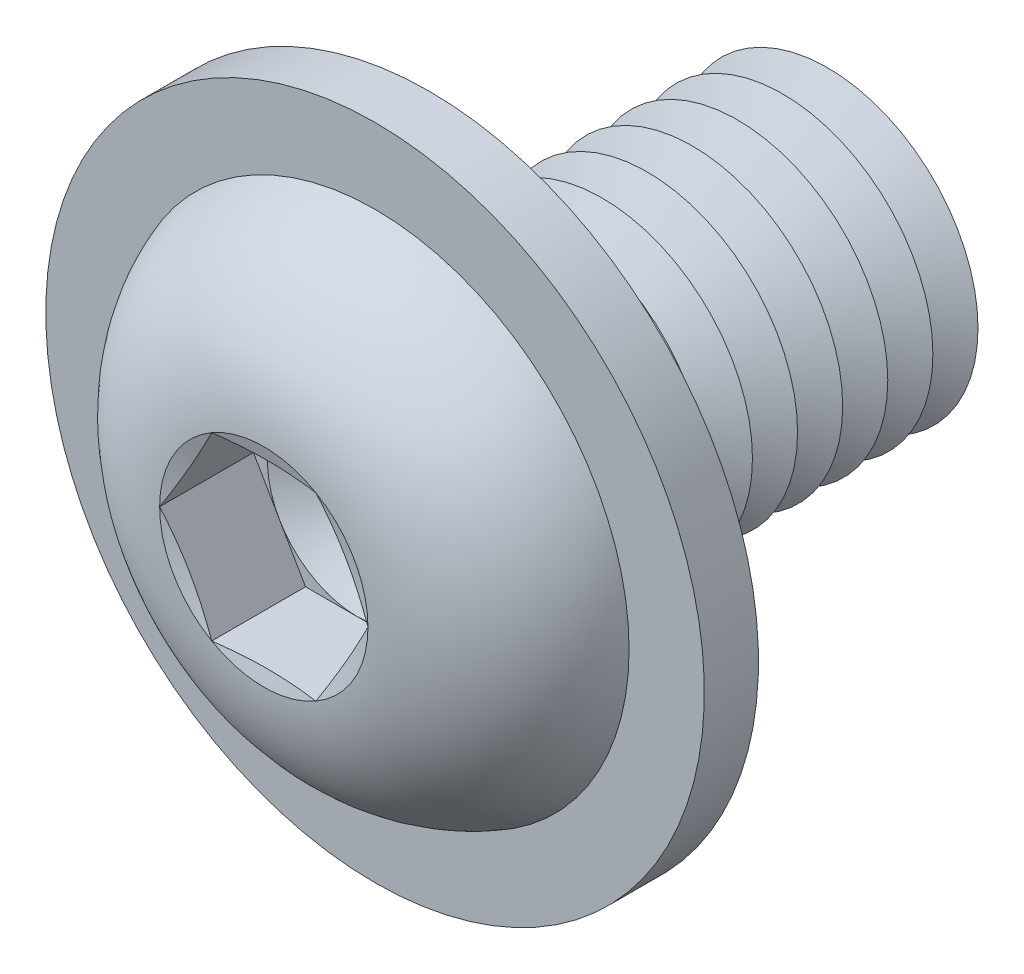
ISO-10303-21;
HEADER;
FILE_DESCRIPTION(('STEP AP214'),'2;1');
FILE_NAME('part.step','',(''),(''),'','','');
FILE_SCHEMA(('AUTOMOTIVE_DESIGN { 1 0 10303 214 1 1 1 1 }'));
ENDSEC;
DATA;
#1=APPLICATION_CONTEXT('core data for automotive mechanical design processes');
#2=APPLICATION_PROTOCOL_DEFINITION('international standard','automotive_design',2000,#1);
#3=PRODUCT_CONTEXT('',#1,'mechanical');
#4=PRODUCT('Part','Part','',(#3));
#5=PRODUCT_RELATED_PRODUCT_CATEGORY('part','',(#4));
#6=PRODUCT_DEFINITION_FORMATION('','',#4);
#7=PRODUCT_DEFINITION_CONTEXT('part definition',#1,'design');
#8=PRODUCT_DEFINITION('design','',#6,#7);
#9=PRODUCT_DEFINITION_SHAPE('','',#8);
#10=(LENGTH_UNIT() NAMED_UNIT(*) SI_UNIT(.MILLI.,.METRE.));
#11=(NAMED_UNIT(*) PLANE_ANGLE_UNIT() SI_UNIT($,.RADIAN.));
#12=(NAMED_UNIT(*) SI_UNIT($,.STERADIAN.) SOLID_ANGLE_UNIT());
#13=UNCERTAINTY_MEASURE_WITH_UNIT(LENGTH_MEASURE(1.E-05),#10,'distance_accuracy_value','');
#14=(GEOMETRIC_REPRESENTATION_CONTEXT(3) GLOBAL_UNCERTAINTY_ASSIGNED_CONTEXT((#13)) GLOBAL_UNIT_ASSIGNED_CONTEXT((#10,
#11,#12)) REPRESENTATION_CONTEXT('',''));
#15=CARTESIAN_POINT('',(0.,0.,0.));
#16=DIRECTION('',(0.,0.,1.));
#17=DIRECTION('',(1.,0.,0.));
#18=AXIS2_PLACEMENT_3D('',#15,#16,#17);
#19=CARTESIAN_POINT('',(0.,0.,-8.75));
#20=DIRECTION('',(0.,0.,1.));
#21=DIRECTION('',(1.,0.,0.));
#22=AXIS2_PLACEMENT_3D('',#19,#20,#21);
#23=CONICAL_SURFACE('',#22,5.,1.0471975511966);
#24=CARTESIAN_POINT('',(0.,0.,-9.5));
#25=DIRECTION('',(0.,0.,1.));
#26=DIRECTION('',(1.,0.,0.));
#27=AXIS2_PLACEMENT_3D('',#24,#25,#26);
#28=CIRCLE('',#27,3.70096189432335);
#29=CARTESIAN_POINT('',(3.70096189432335,0.,-9.5));
#30=VERTEX_POINT('',#29);
#31=EDGE_CURVE('E343',#30,#30,#28,.T.);
#32=ORIENTED_EDGE('',*,*,#31,.T.);
#33=EDGE_LOOP('',(#32));
#34=FACE_BOUND('',#33,.T.);
#35=CARTESIAN_POINT('',(0.,0.,-8.75));
#36=DIRECTION('',(0.,0.,1.));
#37=DIRECTION('',(1.,0.,0.));
#38=AXIS2_PLACEMENT_3D('',#35,#36,#37);
#39=CIRCLE('',#38,5.);
#40=CARTESIAN_POINT('',(5.,0.,-8.75));
#41=VERTEX_POINT('',#40);
#42=EDGE_CURVE('E339',#41,#41,#39,.T.);
#43=ORIENTED_EDGE('',*,*,#42,.F.);
#44=EDGE_LOOP('',(#43));
#45=FACE_BOUND('',#44,.T.);
#46=ADVANCED_FACE('F39',(#34,#45),#23,.T.);
#47=CARTESIAN_POINT('',(0.,0.,-9.5));
#48=DIRECTION('',(0.,0.,-1.));
#49=DIRECTION('',(-1.,0.,0.));
#50=AXIS2_PLACEMENT_3D('',#47,#48,#49);
#51=CONICAL_SURFACE('',#50,3.70096189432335,1.0471975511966);
#52=CARTESIAN_POINT('',(0.,0.,-10.25));
#53=DIRECTION('',(0.,0.,1.));
#54=DIRECTION('',(1.,0.,0.));
#55=AXIS2_PLACEMENT_3D('',#52,#53,#54);
#56=CIRCLE('',#55,5.);
#57=CARTESIAN_POINT('',(5.,0.,-10.25));
#58=VERTEX_POINT('',#57);
#59=EDGE_CURVE('E347',#58,#58,#56,.T.);
#60=ORIENTED_EDGE('',*,*,#59,.T.);
#61=EDGE_LOOP('',(#60));
#62=FACE_BOUND('',#61,.T.);
#63=ORIENTED_EDGE('',*,*,#31,.F.);
#64=EDGE_LOOP('',(#63));
#65=FACE_BOUND('',#64,.T.);
#66=ADVANCED_FACE('F388',(#62,#65),#51,.T.);
#67=CARTESIAN_POINT('',(0.,5.00000000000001,-14.));
#68=DIRECTION('',(0.,0.,-1.));
#69=DIRECTION('',(-1.,0.,0.));
#70=AXIS2_PLACEMENT_3D('',#67,#68,#69);
#71=PLANE('',#70);
#72=CARTESIAN_POINT('',(0.,0.,-14.));
#73=DIRECTION('',(0.,0.,1.));
#74=DIRECTION('',(1.,0.,0.));
#75=AXIS2_PLACEMENT_3D('',#72,#73,#74);
#76=CIRCLE('',#75,3.70096189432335);
#77=CARTESIAN_POINT('',(3.70096189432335,0.,-14.));
#78=VERTEX_POINT('',#77);
#79=EDGE_CURVE('E305',#78,#78,#76,.T.);
#80=ORIENTED_EDGE('',*,*,#79,.F.);
#81=EDGE_LOOP('',(#80));
#82=FACE_BOUND('',#81,.T.);
#83=ADVANCED_FACE('F383',(#82),#71,.T.);
#84=CARTESIAN_POINT('',(0.,0.,-13.25));
#85=DIRECTION('',(0.,0.,1.));
#86=DIRECTION('',(1.,0.,0.));
#87=AXIS2_PLACEMENT_3D('',#84,#85,#86);
#88=CONICAL_SURFACE('',#87,5.,1.0471975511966);
#89=ORIENTED_EDGE('',*,*,#79,.T.);
#90=EDGE_LOOP('',(#89));
#91=FACE_BOUND('',#90,.T.);
#92=CARTESIAN_POINT('',(0.,0.,-13.25));
#93=DIRECTION('',(0.,0.,1.));
#94=DIRECTION('',(1.,0.,0.));
#95=AXIS2_PLACEMENT_3D('',#92,#93,#94);
#96=CIRCLE('',#95,5.);
#97=CARTESIAN_POINT('',(5.,0.,-13.25));
#98=VERTEX_POINT('',#97);
#99=EDGE_CURVE('E330',#98,#98,#96,.T.);
#100=ORIENTED_EDGE('',*,*,#99,.F.);
#101=EDGE_LOOP('',(#100));
#102=FACE_BOUND('',#101,.T.);
#103=ADVANCED_FACE('F374',(#91,#102),#88,.T.);
#104=CARTESIAN_POINT('',(0.,0.,-12.5));
#105=DIRECTION('',(0.,0.,-1.));
#106=DIRECTION('',(-1.,0.,0.));
#107=AXIS2_PLACEMENT_3D('',#104,#105,#106);
#108=CONICAL_SURFACE('',#107,3.70096189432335,1.0471975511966);
#109=ORIENTED_EDGE('',*,*,#99,.T.);
#110=EDGE_LOOP('',(#109));
#111=FACE_BOUND('',#110,.T.);
#112=CARTESIAN_POINT('',(0.,0.,-12.5));
#113=DIRECTION('',(0.,0.,1.));
#114=DIRECTION('',(1.,0.,0.));
#115=AXIS2_PLACEMENT_3D('',#112,#113,#114);
#116=CIRCLE('',#115,3.70096189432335);
#117=CARTESIAN_POINT('',(3.70096189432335,0.,-12.5));
#118=VERTEX_POINT('',#117);
#119=EDGE_CURVE('E333',#118,#118,#116,.T.);
#120=ORIENTED_EDGE('',*,*,#119,.F.);
#121=EDGE_LOOP('',(#120));
#122=FACE_BOUND('',#121,.T.);
#123=ADVANCED_FACE('F372',(#111,#122),#108,.T.);
#124=CARTESIAN_POINT('',(0.,0.,-11.75));
#125=DIRECTION('',(0.,0.,1.));
#126=DIRECTION('',(1.,0.,0.));
#127=AXIS2_PLACEMENT_3D('',#124,#125,#126);
#128=CONICAL_SURFACE('',#127,5.,1.0471975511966);
#129=ORIENTED_EDGE('',*,*,#119,.T.);
#130=EDGE_LOOP('',(#129));
#131=FACE_BOUND('',#130,.T.);
#132=CARTESIAN_POINT('',(0.,0.,-11.75));
#133=DIRECTION('',(0.,0.,1.));
#134=DIRECTION('',(1.,0.,0.));
#135=AXIS2_PLACEMENT_3D('',#132,#133,#134);
#136=CIRCLE('',#135,5.);
#137=CARTESIAN_POINT('',(5.,0.,-11.75));
#138=VERTEX_POINT('',#137);
#139=EDGE_CURVE('E355',#138,#138,#136,.T.);
#140=ORIENTED_EDGE('',*,*,#139,.F.);
#141=EDGE_LOOP('',(#140));
#142=FACE_BOUND('',#141,.T.);
#143=ADVANCED_FACE('F369',(#131,#142),#128,.T.);
#144=CARTESIAN_POINT('',(0.,0.,-11.));
#145=DIRECTION('',(0.,0.,-1.));
#146=DIRECTION('',(-1.,0.,0.));
#147=AXIS2_PLACEMENT_3D('',#144,#145,#146);
#148=CONICAL_SURFACE('',#147,3.70096189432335,1.0471975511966);
#149=ORIENTED_EDGE('',*,*,#139,.T.);
#150=EDGE_LOOP('',(#149));
#151=FACE_BOUND('',#150,.T.);
#152=CARTESIAN_POINT('',(0.,0.,-11.));
#153=DIRECTION('',(0.,0.,1.));
#154=DIRECTION('',(1.,0.,0.));
#155=AXIS2_PLACEMENT_3D('',#152,#153,#154);
#156=CIRCLE('',#155,3.70096189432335);
#157=CARTESIAN_POINT('',(3.70096189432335,0.,-11.));
#158=VERTEX_POINT('',#157);
#159=EDGE_CURVE('E349',#158,#158,#156,.T.);
#160=ORIENTED_EDGE('',*,*,#159,.F.);
#161=EDGE_LOOP('',(#160));
#162=FACE_BOUND('',#161,.T.);
#163=ADVANCED_FACE('F381',(#151,#162),#148,.T.);
#164=CARTESIAN_POINT('',(0.,0.,-10.25));
#165=DIRECTION('',(0.,0.,1.));
#166=DIRECTION('',(1.,0.,0.));
#167=AXIS2_PLACEMENT_3D('',#164,#165,#166);
#168=CONICAL_SURFACE('',#167,5.,1.0471975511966);
#169=ORIENTED_EDGE('',*,*,#159,.T.);
#170=EDGE_LOOP('',(#169));
#171=FACE_BOUND('',#170,.T.);
#172=ORIENTED_EDGE('',*,*,#59,.F.);
#173=EDGE_LOOP('',(#172));
#174=FACE_BOUND('',#173,.T.);
#175=ADVANCED_FACE('F399',(#171,#174),#168,.T.);
#176=CARTESIAN_POINT('',(0.,0.,-7.25));
#177=DIRECTION('',(0.,0.,1.));
#178=DIRECTION('',(1.,0.,0.));
#179=AXIS2_PLACEMENT_3D('',#176,#177,#178);
#180=CONICAL_SURFACE('',#179,5.,1.0471975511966);
#181=CARTESIAN_POINT('',(0.,0.,-8.));
#182=DIRECTION('',(0.,0.,1.));
#183=DIRECTION('',(1.,0.,0.));
#184=AXIS2_PLACEMENT_3D('',#181,#182,#183);
#185=CIRCLE('',#184,3.70096189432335);
#186=CARTESIAN_POINT('',(3.70096189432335,0.,-8.));
#187=VERTEX_POINT('',#186);
#188=EDGE_CURVE('E336',#187,#187,#185,.T.);
#189=ORIENTED_EDGE('',*,*,#188,.T.);
#190=EDGE_LOOP('',(#189));
#191=FACE_BOUND('',#190,.T.);
#192=CARTESIAN_POINT('',(0.,0.,-7.25));
#193=DIRECTION('',(0.,0.,1.));
#194=DIRECTION('',(1.,0.,0.));
#195=AXIS2_PLACEMENT_3D('',#192,#193,#194);
#196=CIRCLE('',#195,5.);
#197=CARTESIAN_POINT('',(5.,0.,-7.25));
#198=VERTEX_POINT('',#197);
#199=EDGE_CURVE('E340',#198,#198,#196,.T.);
#200=ORIENTED_EDGE('',*,*,#199,.F.);
#201=EDGE_LOOP('',(#200));
#202=FACE_BOUND('',#201,.T.);
#203=ADVANCED_FACE('F402',(#191,#202),#180,.T.);
#204=CARTESIAN_POINT('',(0.,0.,-8.));
#205=DIRECTION('',(0.,0.,-1.));
#206=DIRECTION('',(-1.,0.,0.));
#207=AXIS2_PLACEMENT_3D('',#204,#205,#206);
#208=CONICAL_SURFACE('',#207,3.70096189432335,1.0471975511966);
#209=ORIENTED_EDGE('',*,*,#42,.T.);
#210=EDGE_LOOP('',(#209));
#211=FACE_BOUND('',#210,.T.);
#212=ORIENTED_EDGE('',*,*,#188,.F.);
#213=EDGE_LOOP('',(#212));
#214=FACE_BOUND('',#213,.T.);
#215=ADVANCED_FACE('F407',(#211,#214),#208,.T.);
#216=CARTESIAN_POINT('',(0.,0.,-5.75));
#217=DIRECTION('',(0.,0.,1.));
#218=DIRECTION('',(1.,0.,0.));
#219=AXIS2_PLACEMENT_3D('',#216,#217,#218);
#220=CONICAL_SURFACE('',#219,5.,1.0471975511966);
#221=CARTESIAN_POINT('',(0.,0.,-6.5));
#222=DIRECTION('',(0.,0.,1.));
#223=DIRECTION('',(1.,0.,0.));
#224=AXIS2_PLACEMENT_3D('',#221,#222,#223);
#225=CIRCLE('',#224,3.70096189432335);
#226=CARTESIAN_POINT('',(3.70096189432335,0.,-6.5));
#227=VERTEX_POINT('',#226);
#228=EDGE_CURVE('E479',#227,#227,#225,.T.);
#229=ORIENTED_EDGE('',*,*,#228,.T.);
#230=EDGE_LOOP('',(#229));
#231=FACE_BOUND('',#230,.T.);
#232=CARTESIAN_POINT('',(0.,0.,-5.75));
#233=DIRECTION('',(0.,0.,1.));
#234=DIRECTION('',(1.,0.,0.));
#235=AXIS2_PLACEMENT_3D('',#232,#233,#234);
#236=CIRCLE('',#235,5.);
#237=CARTESIAN_POINT('',(5.,0.,-5.75));
#238=VERTEX_POINT('',#237);
#239=EDGE_CURVE('E475',#238,#238,#236,.T.);
#240=ORIENTED_EDGE('',*,*,#239,.F.);
#241=EDGE_LOOP('',(#240));
#242=FACE_BOUND('',#241,.T.);
#243=ADVANCED_FACE('F415',(#231,#242),#220,.T.);
#244=CARTESIAN_POINT('',(0.,0.,-6.5));
#245=DIRECTION('',(0.,0.,-1.));
#246=DIRECTION('',(-1.,0.,0.));
#247=AXIS2_PLACEMENT_3D('',#244,#245,#246);
#248=CONICAL_SURFACE('',#247,3.70096189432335,1.0471975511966);
#249=ORIENTED_EDGE('',*,*,#199,.T.);
#250=EDGE_LOOP('',(#249));
#251=FACE_BOUND('',#250,.T.);
#252=ORIENTED_EDGE('',*,*,#228,.F.);
#253=EDGE_LOOP('',(#252));
#254=FACE_BOUND('',#253,.T.);
#255=ADVANCED_FACE('F422',(#251,#254),#248,.T.);
#256=CARTESIAN_POINT('',(0.,0.,-4.25));
#257=DIRECTION('',(0.,0.,1.));
#258=DIRECTION('',(1.,0.,0.));
#259=AXIS2_PLACEMENT_3D('',#256,#257,#258);
#260=CONICAL_SURFACE('',#259,5.,1.0471975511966);
#261=CARTESIAN_POINT('',(0.,0.,-5.));
#262=DIRECTION('',(0.,0.,1.));
#263=DIRECTION('',(1.,0.,0.));
#264=AXIS2_PLACEMENT_3D('',#261,#262,#263);
#265=CIRCLE('',#264,3.70096189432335);
#266=CARTESIAN_POINT('',(3.70096189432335,0.,-5.));
#267=VERTEX_POINT('',#266);
#268=EDGE_CURVE('E471',#267,#267,#265,.T.);
#269=ORIENTED_EDGE('',*,*,#268,.T.);
#270=EDGE_LOOP('',(#269));
#271=FACE_BOUND('',#270,.T.);
#272=CARTESIAN_POINT('',(0.,0.,-4.25));
#273=DIRECTION('',(0.,0.,1.));
#274=DIRECTION('',(1.,0.,0.));
#275=AXIS2_PLACEMENT_3D('',#272,#273,#274);
#276=CIRCLE('',#275,5.);
#277=CARTESIAN_POINT('',(5.,0.,-4.25));
#278=VERTEX_POINT('',#277);
#279=EDGE_CURVE('E463',#278,#278,#276,.T.);
#280=ORIENTED_EDGE('',*,*,#279,.F.);
#281=EDGE_LOOP('',(#280));
#282=FACE_BOUND('',#281,.T.);
#283=ADVANCED_FACE('F426',(#271,#282),#260,.T.);
#284=CARTESIAN_POINT('',(0.,0.,-5.));
#285=DIRECTION('',(0.,0.,-1.));
#286=DIRECTION('',(-1.,0.,0.));
#287=AXIS2_PLACEMENT_3D('',#284,#285,#286);
#288=CONICAL_SURFACE('',#287,3.70096189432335,1.0471975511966);
#289=ORIENTED_EDGE('',*,*,#239,.T.);
#290=EDGE_LOOP('',(#289));
#291=FACE_BOUND('',#290,.T.);
#292=ORIENTED_EDGE('',*,*,#268,.F.);
#293=EDGE_LOOP('',(#292));
#294=FACE_BOUND('',#293,.T.);
#295=ADVANCED_FACE('F430',(#291,#294),#288,.T.);
#296=CARTESIAN_POINT('',(0.,0.,-2.75));
#297=DIRECTION('',(0.,0.,1.));
#298=DIRECTION('',(1.,0.,0.));
#299=AXIS2_PLACEMENT_3D('',#296,#297,#298);
#300=CONICAL_SURFACE('',#299,5.,1.0471975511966);
#301=CARTESIAN_POINT('',(0.,0.,-3.5));
#302=DIRECTION('',(0.,0.,1.));
#303=DIRECTION('',(1.,0.,0.));
#304=AXIS2_PLACEMENT_3D('',#301,#302,#303);
#305=CIRCLE('',#304,3.70096189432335);
#306=CARTESIAN_POINT('',(3.70096189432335,0.,-3.5));
#307=VERTEX_POINT('',#306);
#308=EDGE_CURVE('E458',#307,#307,#305,.T.);
#309=ORIENTED_EDGE('',*,*,#308,.T.);
#310=EDGE_LOOP('',(#309));
#311=FACE_BOUND('',#310,.T.);
#312=CARTESIAN_POINT('',(0.,0.,-2.75));
#313=DIRECTION('',(0.,0.,1.));
#314=DIRECTION('',(1.,0.,0.));
#315=AXIS2_PLACEMENT_3D('',#312,#313,#314);
#316=CIRCLE('',#315,5.);
#317=CARTESIAN_POINT('',(5.,0.,-2.75));
#318=VERTEX_POINT('',#317);
#319=EDGE_CURVE('E459',#318,#318,#316,.T.);
#320=ORIENTED_EDGE('',*,*,#319,.F.);
#321=EDGE_LOOP('',(#320));
#322=FACE_BOUND('',#321,.T.);
#323=ADVANCED_FACE('F434',(#311,#322),#300,.T.);
#324=CARTESIAN_POINT('',(0.,0.,-3.5));
#325=DIRECTION('',(0.,0.,-1.));
#326=DIRECTION('',(-1.,0.,0.));
#327=AXIS2_PLACEMENT_3D('',#324,#325,#326);
#328=CONICAL_SURFACE('',#327,3.70096189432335,1.0471975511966);
#329=ORIENTED_EDGE('',*,*,#279,.T.);
#330=EDGE_LOOP('',(#329));
#331=FACE_BOUND('',#330,.T.);
#332=ORIENTED_EDGE('',*,*,#308,.F.);
#333=EDGE_LOOP('',(#332));
#334=FACE_BOUND('',#333,.T.);
#335=ADVANCED_FACE('F438',(#331,#334),#328,.T.);
#336=CARTESIAN_POINT('',(0.,0.,-1.25));
#337=DIRECTION('',(0.,0.,1.));
#338=DIRECTION('',(1.,0.,0.));
#339=AXIS2_PLACEMENT_3D('',#336,#337,#338);
#340=CONICAL_SURFACE('',#339,5.,1.0471975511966);
#341=CARTESIAN_POINT('',(0.,0.,-2.));
#342=DIRECTION('',(0.,0.,1.));
#343=DIRECTION('',(1.,0.,0.));
#344=AXIS2_PLACEMENT_3D('',#341,#342,#343);
#345=CIRCLE('',#344,3.70096189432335);
#346=CARTESIAN_POINT('',(3.70096189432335,0.,-2.));
#347=VERTEX_POINT('',#346);
#348=EDGE_CURVE('E227',#347,#347,#345,.T.);
#349=ORIENTED_EDGE('',*,*,#348,.T.);
#350=EDGE_LOOP('',(#349));
#351=FACE_BOUND('',#350,.T.);
#352=CARTESIAN_POINT('',(0.,0.,-1.25));
#353=DIRECTION('',(0.,0.,1.));
#354=DIRECTION('',(1.,0.,0.));
#355=AXIS2_PLACEMENT_3D('',#352,#353,#354);
#356=CIRCLE('',#355,5.);
#357=CARTESIAN_POINT('',(5.,0.,-1.25));
#358=VERTEX_POINT('',#357);
#359=EDGE_CURVE('E455',#358,#358,#356,.T.);
#360=ORIENTED_EDGE('',*,*,#359,.F.);
#361=EDGE_LOOP('',(#360));
#362=FACE_BOUND('',#361,.T.);
#363=ADVANCED_FACE('F441',(#351,#362),#340,.T.);
#364=CARTESIAN_POINT('',(0.,0.,-2.));
#365=DIRECTION('',(0.,0.,-1.));
#366=DIRECTION('',(-1.,0.,0.));
#367=AXIS2_PLACEMENT_3D('',#364,#365,#366);
#368=CONICAL_SURFACE('',#367,3.70096189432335,1.0471975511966);
#369=ORIENTED_EDGE('',*,*,#319,.T.);
#370=EDGE_LOOP('',(#369));
#371=FACE_BOUND('',#370,.T.);
#372=ORIENTED_EDGE('',*,*,#348,.F.);
#373=EDGE_LOOP('',(#372));
#374=FACE_BOUND('',#373,.T.);
#375=ADVANCED_FACE('F211',(#371,#374),#368,.T.);
#376=CARTESIAN_POINT('',(0.,5.,0.));
#377=DIRECTION('',(0.,0.,-1.));
#378=DIRECTION('',(-1.,0.,0.));
#379=AXIS2_PLACEMENT_3D('',#376,#377,#378);
#380=PLANE('',#379);
#381=CARTESIAN_POINT('',(0.,0.,0.));
#382=DIRECTION('',(0.,0.,-1.));
#383=DIRECTION('',(-1.,0.,0.));
#384=AXIS2_PLACEMENT_3D('',#381,#382,#383);
#385=CIRCLE('',#384,5.75);
#386=CARTESIAN_POINT('',(-5.75,0.,0.));
#387=VERTEX_POINT('',#386);
#388=EDGE_CURVE('E282',#387,#387,#385,.F.);
#389=ORIENTED_EDGE('',*,*,#388,.T.);
#390=EDGE_LOOP('',(#389));
#391=FACE_BOUND('',#390,.T.);
#392=CARTESIAN_POINT('',(0.,0.,0.));
#393=DIRECTION('',(0.,0.,-1.));
#394=DIRECTION('',(0.,1.,0.));
#395=AXIS2_PLACEMENT_3D('',#392,#393,#394);
#396=CIRCLE('',#395,10.95);
#397=CARTESIAN_POINT('',(0.,10.95,0.));
#398=VERTEX_POINT('',#397);
#399=EDGE_CURVE('E540',#398,#398,#396,.T.);
#400=ORIENTED_EDGE('',*,*,#399,.T.);
#401=EDGE_LOOP('',(#400));
#402=FACE_BOUND('',#401,.T.);
#403=ADVANCED_FACE('F448',(#391,#402),#380,.T.);
#404=CARTESIAN_POINT('',(0.,0.,-0.749999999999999));
#405=DIRECTION('',(0.,0.,-1.));
#406=DIRECTION('',(-1.,0.,0.));
#407=AXIS2_PLACEMENT_3D('',#404,#405,#406);
#408=TOROIDAL_SURFACE('',#407,5.75,0.75);
#409=ORIENTED_EDGE('',*,*,#388,.F.);
#410=EDGE_LOOP('',(#409));
#411=FACE_BOUND('',#410,.T.);
#412=CARTESIAN_POINT('',(0.,0.,-0.749999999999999));
#413=DIRECTION('',(0.,0.,-1.));
#414=DIRECTION('',(-1.,0.,0.));
#415=AXIS2_PLACEMENT_3D('',#412,#413,#414);
#416=CIRCLE('',#415,5.);
#417=CARTESIAN_POINT('',(-5.,0.,-0.749999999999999));
#418=VERTEX_POINT('',#417);
#419=EDGE_CURVE('E288',#418,#418,#416,.T.);
#420=ORIENTED_EDGE('',*,*,#419,.F.);
#421=EDGE_LOOP('',(#420));
#422=FACE_BOUND('',#421,.T.);
#423=ADVANCED_FACE('F41',(#411,#422),#408,.F.);
#424=CARTESIAN_POINT('',(0.,0.,-14.));
#425=DIRECTION('',(0.,0.,-1.));
#426=DIRECTION('',(-1.,0.,0.));
#427=AXIS2_PLACEMENT_3D('',#424,#425,#426);
#428=CYLINDRICAL_SURFACE('',#427,5.);
#429=ORIENTED_EDGE('',*,*,#419,.T.);
#430=EDGE_LOOP('',(#429));
#431=FACE_BOUND('',#430,.T.);
#432=ORIENTED_EDGE('',*,*,#359,.T.);
#433=EDGE_LOOP('',(#432));
#434=FACE_BOUND('',#433,.T.);
#435=ADVANCED_FACE('F558',(#431,#434),#428,.T.);
#436=CARTESIAN_POINT('',(0.,0.,1.8));
#437=DIRECTION('',(0.,0.,-1.));
#438=DIRECTION('',(0.,1.,0.));
#439=AXIS2_PLACEMENT_3D('',#436,#437,#438);
#440=CYLINDRICAL_SURFACE('',#439,10.95);
#441=CARTESIAN_POINT('',(0.,0.,1.8));
#442=DIRECTION('',(0.,0.,-1.));
#443=DIRECTION('',(0.,1.,0.));
#444=AXIS2_PLACEMENT_3D('',#441,#442,#443);
#445=CIRCLE('',#444,10.95);
#446=CARTESIAN_POINT('',(0.,10.95,1.8));
#447=VERTEX_POINT('',#446);
#448=EDGE_CURVE('E327',#447,#447,#445,.T.);
#449=ORIENTED_EDGE('',*,*,#448,.T.);
#450=EDGE_LOOP('',(#449));
#451=FACE_BOUND('',#450,.T.);
#452=ORIENTED_EDGE('',*,*,#399,.F.);
#453=EDGE_LOOP('',(#452));
#454=FACE_BOUND('',#453,.T.);
#455=ADVANCED_FACE('F549',(#451,#454),#440,.T.);
#456=CARTESIAN_POINT('',(0.,0.,1.8));
#457=DIRECTION('',(0.,0.,-1.));
#458=DIRECTION('',(0.,1.,0.));
#459=AXIS2_PLACEMENT_3D('',#456,#457,#458);
#460=PLANE('',#459);
#461=CARTESIAN_POINT('',(0.,0.,1.8));
#462=DIRECTION('',(0.,0.,-1.));
#463=DIRECTION('',(0.,1.,0.));
#464=AXIS2_PLACEMENT_3D('',#461,#462,#463);
#465=CIRCLE('',#464,8.44736706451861);
#466=CARTESIAN_POINT('',(0.,8.44736706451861,1.8));
#467=VERTEX_POINT('',#466);
#468=EDGE_CURVE('E43',#467,#467,#465,.F.);
#469=ORIENTED_EDGE('',*,*,#468,.F.);
#470=EDGE_LOOP('',(#469));
#471=FACE_BOUND('',#470,.T.);
#472=ORIENTED_EDGE('',*,*,#448,.F.);
#473=EDGE_LOOP('',(#472));
#474=FACE_BOUND('',#473,.T.);
#475=ADVANCED_FACE('F117',(#471,#474),#460,.F.);
#476=CARTESIAN_POINT('',(0.,0.,2.38));
#477=DIRECTION('',(0.,0.,1.));
#478=DIRECTION('',(1.,0.,0.));
#479=AXIS2_PLACEMENT_3D('',#476,#477,#478);
#480=CONICAL_SURFACE('',#479,2.99999860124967,1.0471975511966);
#481=CARTESIAN_POINT('',(0.,0.,0.64795000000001));
#482=VERTEX_POINT('',#481);
#483=VERTEX_LOOP('',#482);
#484=FACE_BOUND('',#483,.T.);
#485=CARTESIAN_POINT('',(0.,0.,2.38));
#486=DIRECTION('',(0.,0.,1.));
#487=DIRECTION('',(1.,0.,0.));
#488=AXIS2_PLACEMENT_3D('',#485,#486,#487);
#489=CIRCLE('',#488,2.99999860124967);
#490=CARTESIAN_POINT('',(2.598075,1.49999930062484,2.38));
#491=VERTEX_POINT('',#490);
#492=CARTESIAN_POINT('',(0.,2.99999860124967,2.38));
#493=VERTEX_POINT('',#492);
#494=EDGE_CURVE('E120',#491,#493,#489,.T.);
#495=ORIENTED_EDGE('',*,*,#494,.T.);
#496=CARTESIAN_POINT('',(0.,0.,2.38));
#497=DIRECTION('',(0.,0.,1.));
#498=DIRECTION('',(1.,0.,0.));
#499=AXIS2_PLACEMENT_3D('',#496,#497,#498);
#500=CIRCLE('',#499,2.99999860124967);
#501=CARTESIAN_POINT('',(-2.598075,1.49999930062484,2.38));
#502=VERTEX_POINT('',#501);
#503=EDGE_CURVE('E11',#493,#502,#500,.T.);
#504=ORIENTED_EDGE('',*,*,#503,.T.);
#505=CARTESIAN_POINT('',(-2.598075,-1.49999930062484,2.38));
#506=VERTEX_POINT('',#505);
#507=EDGE_CURVE('E49',#502,#506,#500,.T.);
#508=ORIENTED_EDGE('',*,*,#507,.T.);
#509=CARTESIAN_POINT('',(0.,-2.99999860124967,2.38));
#510=VERTEX_POINT('',#509);
#511=EDGE_CURVE('E285',#506,#510,#500,.T.);
#512=ORIENTED_EDGE('',*,*,#511,.T.);
#513=CARTESIAN_POINT('',(2.598075,-1.49999930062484,2.38));
#514=VERTEX_POINT('',#513);
#515=EDGE_CURVE('E57',#510,#514,#500,.T.);
#516=ORIENTED_EDGE('',*,*,#515,.T.);
#517=EDGE_CURVE('E50',#514,#491,#500,.T.);
#518=ORIENTED_EDGE('',*,*,#517,.T.);
#519=EDGE_LOOP('',(#495,#504,#508,#512,#516,#518));
#520=FACE_BOUND('',#519,.T.);
#521=ADVANCED_FACE('F114',(#484,#520),#480,.F.);
#522=CARTESIAN_POINT('',(0.,0.,2.38));
#523=DIRECTION('',(0.,0.,1.));
#524=DIRECTION('',(1.,0.,0.));
#525=AXIS2_PLACEMENT_3D('',#522,#523,#524);
#526=PLANE('',#525);
#527=ORIENTED_EDGE('',*,*,#511,.F.);
#528=DIRECTION('',(0.5,-0.866025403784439,0.));
#529=VECTOR('',#528,1.);
#530=CARTESIAN_POINT('',(-3.4641,0.,2.38));
#531=LINE('',#530,#529);
#532=CARTESIAN_POINT('',(-1.73205,-2.99999860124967,2.38));
#533=VERTEX_POINT('',#532);
#534=EDGE_CURVE('E154',#506,#533,#531,.T.);
#535=ORIENTED_EDGE('',*,*,#534,.T.);
#536=DIRECTION('',(1.,0.,0.));
#537=VECTOR('',#536,1.);
#538=CARTESIAN_POINT('',(-1.73205,-2.99999860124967,2.38));
#539=LINE('',#538,#537);
#540=EDGE_CURVE('E160',#533,#510,#539,.T.);
#541=ORIENTED_EDGE('',*,*,#540,.T.);
#542=EDGE_LOOP('',(#527,#535,#541));
#543=FACE_BOUND('',#542,.T.);
#544=ADVANCED_FACE('F116',(#543),#526,.T.);
#545=ORIENTED_EDGE('',*,*,#515,.F.);
#546=CARTESIAN_POINT('',(1.73205,-2.99999860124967,2.38));
#547=VERTEX_POINT('',#546);
#548=EDGE_CURVE('E159',#510,#547,#539,.T.);
#549=ORIENTED_EDGE('',*,*,#548,.T.);
#550=DIRECTION('',(0.5,0.866025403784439,0.));
#551=VECTOR('',#550,1.);
#552=CARTESIAN_POINT('',(1.73205,-2.99999860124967,2.38));
#553=LINE('',#552,#551);
#554=EDGE_CURVE('E164',#547,#514,#553,.T.);
#555=ORIENTED_EDGE('',*,*,#554,.T.);
#556=EDGE_LOOP('',(#545,#549,#555));
#557=FACE_BOUND('',#556,.T.);
#558=ADVANCED_FACE('F563',(#557),#526,.T.);
#559=ORIENTED_EDGE('',*,*,#517,.F.);
#560=CARTESIAN_POINT('',(3.4641,0.,2.38));
#561=VERTEX_POINT('',#560);
#562=EDGE_CURVE('E163',#514,#561,#553,.T.);
#563=ORIENTED_EDGE('',*,*,#562,.T.);
#564=DIRECTION('',(-0.5,0.866025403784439,0.));
#565=VECTOR('',#564,1.);
#566=CARTESIAN_POINT('',(3.4641,0.,2.38));
#567=LINE('',#566,#565);
#568=EDGE_CURVE('E142',#561,#491,#567,.T.);
#569=ORIENTED_EDGE('',*,*,#568,.T.);
#570=EDGE_LOOP('',(#559,#563,#569));
#571=FACE_BOUND('',#570,.T.);
#572=ADVANCED_FACE('F561',(#571),#526,.T.);
#573=ORIENTED_EDGE('',*,*,#494,.F.);
#574=CARTESIAN_POINT('',(1.73205,2.99999860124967,2.38));
#575=VERTEX_POINT('',#574);
#576=EDGE_CURVE('E127',#491,#575,#567,.T.);
#577=ORIENTED_EDGE('',*,*,#576,.T.);
#578=DIRECTION('',(-1.,0.,0.));
#579=VECTOR('',#578,1.);
#580=CARTESIAN_POINT('',(1.73205,2.99999860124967,2.38));
#581=LINE('',#580,#579);
#582=EDGE_CURVE('E138',#575,#493,#581,.T.);
#583=ORIENTED_EDGE('',*,*,#582,.T.);
#584=EDGE_LOOP('',(#573,#577,#583));
#585=FACE_BOUND('',#584,.T.);
#586=ADVANCED_FACE('F144',(#585),#526,.T.);
#587=ORIENTED_EDGE('',*,*,#503,.F.);
#588=CARTESIAN_POINT('',(-1.73205,2.99999860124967,2.38));
#589=VERTEX_POINT('',#588);
#590=EDGE_CURVE('E133',#493,#589,#581,.T.);
#591=ORIENTED_EDGE('',*,*,#590,.T.);
#592=DIRECTION('',(-0.5,-0.866025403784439,0.));
#593=VECTOR('',#592,1.);
#594=CARTESIAN_POINT('',(-1.73205,2.99999860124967,2.38));
#595=LINE('',#594,#593);
#596=EDGE_CURVE('E136',#589,#502,#595,.T.);
#597=ORIENTED_EDGE('',*,*,#596,.T.);
#598=EDGE_LOOP('',(#587,#591,#597));
#599=FACE_BOUND('',#598,.T.);
#600=ADVANCED_FACE('F132',(#599),#526,.T.);
#601=ORIENTED_EDGE('',*,*,#507,.F.);
#602=CARTESIAN_POINT('',(-3.4641,0.,2.38));
#603=VERTEX_POINT('',#602);
#604=EDGE_CURVE('E146',#502,#603,#595,.T.);
#605=ORIENTED_EDGE('',*,*,#604,.T.);
#606=EDGE_CURVE('E155',#603,#506,#531,.T.);
#607=ORIENTED_EDGE('',*,*,#606,.T.);
#608=EDGE_LOOP('',(#601,#605,#607));
#609=FACE_BOUND('',#608,.T.);
#610=ADVANCED_FACE('F262',(#609),#526,.T.);
#611=CARTESIAN_POINT('',(-3.4641,0.,2.38));
#612=DIRECTION('',(-0.866025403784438,-0.5,0.));
#613=DIRECTION('',(0.5,-0.866025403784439,0.));
#614=AXIS2_PLACEMENT_3D('',#611,#612,#613);
#615=PLANE('',#614);
#616=CARTESIAN_POINT('',(-3.46421547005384,0.000200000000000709,5.50003094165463));
#617=CARTESIAN_POINT('',(-3.39227822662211,-0.12439896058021,5.48074619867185));
#618=CARTESIAN_POINT('',(-3.32021054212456,-0.249223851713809,5.46323875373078));
#619=CARTESIAN_POINT('',(-3.17582062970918,-0.499314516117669,5.43247971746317));
#620=CARTESIAN_POINT('',(-3.10349831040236,-0.624580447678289,5.41922985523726));
#621=CARTESIAN_POINT('',(-2.95903767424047,-0.874793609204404,5.39775958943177));
#622=CARTESIAN_POINT('',(-2.88690033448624,-0.999739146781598,5.38951357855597));
#623=CARTESIAN_POINT('',(-2.74253364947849,-1.24978958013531,5.37845651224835));
#624=CARTESIAN_POINT('',(-2.67030432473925,-1.37489444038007,5.3756444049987));
#625=CARTESIAN_POINT('',(-2.52584567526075,-1.6251041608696,5.3756444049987));
#626=CARTESIAN_POINT('',(-2.45361635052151,-1.75020902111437,5.37845651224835));
#627=CARTESIAN_POINT('',(-2.30924966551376,-2.00025945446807,5.38951357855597));
#628=CARTESIAN_POINT('',(-2.23711232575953,-2.12520499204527,5.39775958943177));
#629=CARTESIAN_POINT('',(-2.09265168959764,-2.37541815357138,5.41922985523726));
#630=CARTESIAN_POINT('',(-2.02032937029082,-2.500684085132,5.43247971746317));
#631=CARTESIAN_POINT('',(-1.87593945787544,-2.75077474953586,5.46323875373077));
#632=CARTESIAN_POINT('',(-1.80387177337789,-2.87559964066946,5.48074619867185));
#633=CARTESIAN_POINT('',(-1.73193452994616,-3.00019860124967,5.50003094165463));
#634=B_SPLINE_CURVE_WITH_KNOTS('',3,(#616,#617,#618,#619,#620,#621,#622,#623,#624,#625,#626,
#627,#628,#629,#630,#631,#632,#633),.UNSPECIFIED.,.F.,.F.,(4,2,2,2,2,2,2,2,4),(0.,
0.435506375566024,0.871189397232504,1.3046235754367,1.7379738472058,2.1713241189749,
2.6047582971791,3.04044131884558,3.4759476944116),.UNSPECIFIED.);
#635=CARTESIAN_POINT('',(-3.4641,0.,5.5));
#636=VERTEX_POINT('',#635);
#637=CARTESIAN_POINT('',(-1.73205,-2.99999860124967,5.5));
#638=VERTEX_POINT('',#637);
#639=EDGE_CURVE('E238',#636,#638,#634,.T.);
#640=ORIENTED_EDGE('',*,*,#639,.T.);
#641=DIRECTION('',(0.,0.,1.));
#642=VECTOR('',#641,1.);
#643=CARTESIAN_POINT('',(-1.73205,-2.99999860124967,2.38));
#644=LINE('',#643,#642);
#645=EDGE_CURVE('E178',#533,#638,#644,.T.);
#646=ORIENTED_EDGE('',*,*,#645,.F.);
#647=ORIENTED_EDGE('',*,*,#534,.F.);
#648=ORIENTED_EDGE('',*,*,#606,.F.);
#649=DIRECTION('',(0.,0.,1.));
#650=VECTOR('',#649,1.);
#651=CARTESIAN_POINT('',(-3.4641,0.,2.38));
#652=LINE('',#651,#650);
#653=EDGE_CURVE('E174',#603,#636,#652,.T.);
#654=ORIENTED_EDGE('',*,*,#653,.T.);
#655=EDGE_LOOP('',(#640,#646,#647,#648,#654));
#656=FACE_BOUND('',#655,.T.);
#657=ADVANCED_FACE('F256',(#656),#615,.F.);
#658=CARTESIAN_POINT('',(-1.73205,-2.99999860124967,2.38));
#659=DIRECTION('',(0.,-1.,0.));
#660=DIRECTION('',(0.,0.,-1.));
#661=AXIS2_PLACEMENT_3D('',#658,#659,#660);
#662=PLANE('',#661);
#663=CARTESIAN_POINT('',(-5.2273006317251,-2.99999860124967,6.18672552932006));
#664=CARTESIAN_POINT('',(-5.10075887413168,-2.99999860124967,6.15732018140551));
#665=CARTESIAN_POINT('',(-4.97415993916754,-2.99999860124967,6.12816064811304));
#666=CARTESIAN_POINT('',(-4.72082394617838,-2.99999860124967,6.07043857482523));
#667=CARTESIAN_POINT('',(-4.59408688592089,-2.99999860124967,6.04187604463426));
#668=CARTESIAN_POINT('',(-4.21358997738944,-2.99999860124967,5.95723252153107));
#669=CARTESIAN_POINT('',(-3.95959339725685,-2.99999860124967,5.90220706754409));
#670=CARTESIAN_POINT('',(-3.44835573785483,-2.99999860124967,5.79574115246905));
#671=CARTESIAN_POINT('',(-3.19110656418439,-2.99999860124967,5.74433913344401));
#672=CARTESIAN_POINT('',(-2.67540790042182,-2.99999860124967,5.6477299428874));
#673=CARTESIAN_POINT('',(-2.41695830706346,-2.99999860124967,5.60252331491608));
#674=CARTESIAN_POINT('',(-1.9055512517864,-2.99999860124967,5.52251897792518));
#675=CARTESIAN_POINT('',(-1.65263426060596,-2.99999860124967,5.48747285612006));
#676=CARTESIAN_POINT('',(-1.27220564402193,-2.99999860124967,5.44439602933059));
#677=CARTESIAN_POINT('',(-1.1452320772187,-2.99999860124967,5.43161987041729));
#678=CARTESIAN_POINT('',(-0.890973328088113,-2.99999860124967,5.40972605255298));
#679=CARTESIAN_POINT('',(-0.763688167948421,-2.99999860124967,5.40060814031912));
#680=CARTESIAN_POINT('',(-0.509442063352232,-2.99999860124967,5.38647457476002));
#681=CARTESIAN_POINT('',(-0.382482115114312,-2.99999860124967,5.38144125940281));
#682=CARTESIAN_POINT('',(-0.128463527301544,-2.99999860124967,5.37566637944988));
#683=CARTESIAN_POINT('',(-0.00140488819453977,-2.99999860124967,5.37492479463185));
#684=CARTESIAN_POINT('',(0.252672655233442,-2.99999860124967,5.37777315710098));
#685=CARTESIAN_POINT('',(0.379691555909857,-2.99999860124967,5.38136342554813));
#686=CARTESIAN_POINT('',(0.63354019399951,-2.99999860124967,5.39268816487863));
#687=CARTESIAN_POINT('',(0.760369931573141,-2.99999860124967,5.40042263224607));
#688=CARTESIAN_POINT('',(1.06836981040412,-2.99999860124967,5.42382465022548));
#689=CARTESIAN_POINT('',(1.24938929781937,-2.99999860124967,5.4414748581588));
#690=CARTESIAN_POINT('',(1.61066786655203,-2.99999860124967,5.48312309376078));
#691=CARTESIAN_POINT('',(1.7909269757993,-2.99999860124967,5.50712088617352));
#692=CARTESIAN_POINT('',(2.15127612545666,-2.99999860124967,5.56013471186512));
#693=CARTESIAN_POINT('',(2.33136383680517,-2.99999860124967,5.58916634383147));
#694=CARTESIAN_POINT('',(2.690892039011,-2.99999860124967,5.65100028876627));
#695=CARTESIAN_POINT('',(2.87033249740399,-2.99999860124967,5.68380278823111));
#696=CARTESIAN_POINT('',(3.23235399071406,-2.99999860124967,5.75295369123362));
#697=CARTESIAN_POINT('',(3.4149236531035,-2.99999860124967,5.78936117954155));
#698=CARTESIAN_POINT('',(3.77960351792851,-2.99999860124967,5.864406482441));
#699=CARTESIAN_POINT('',(3.96171371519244,-2.99999860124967,5.903044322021));
#700=CARTESIAN_POINT('',(4.32457472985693,-2.99999860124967,5.9817966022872));
#701=CARTESIAN_POINT('',(4.5053275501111,-2.99999860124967,6.02190185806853));
#702=CARTESIAN_POINT('',(4.86652484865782,-2.99999860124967,6.10342152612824));
#703=CARTESIAN_POINT('',(5.04696934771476,-2.99999860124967,6.14483584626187));
#704=CARTESIAN_POINT('',(5.2273006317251,-2.99999860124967,6.18672552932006));
#705=B_SPLINE_CURVE_WITH_KNOTS('',3,(#663,#664,#665,#666,#667,#668,#669,#670,#671,#672,#673,
#674,#675,#676,#677,#678,#679,#680,#681,#682,#683,#684,#685,#686,#687,#688,#689,#690,#691,#692,
#693,#694,#695,#696,#697,#698,#699,#700,#701,#702,#703,#704),.UNSPECIFIED.,.F.,.F.,(4,2,2,2,2,2,
2,2,2,2,2,2,2,2,2,2,2,2,2,2,4),(0.,0.389739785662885,0.779485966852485,1.5591292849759,
2.34608117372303,3.13310206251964,3.8988410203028,4.28164148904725,4.66441544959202,
5.04552531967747,5.42663339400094,5.80776972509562,6.18890573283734,6.73438998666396,
7.27985402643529,7.8270395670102,8.37425218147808,8.93272720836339,9.49120849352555,
10.0466490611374,10.6020506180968),.UNSPECIFIED.);
#706=CARTESIAN_POINT('',(1.73205,-2.99999860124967,5.5));
#707=VERTEX_POINT('',#706);
#708=EDGE_CURVE('E243',#638,#707,#705,.T.);
#709=ORIENTED_EDGE('',*,*,#708,.T.);
#710=DIRECTION('',(0.,0.,1.));
#711=VECTOR('',#710,1.);
#712=CARTESIAN_POINT('',(1.73205,-2.99999860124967,2.38));
#713=LINE('',#712,#711);
#714=EDGE_CURVE('E173',#547,#707,#713,.T.);
#715=ORIENTED_EDGE('',*,*,#714,.F.);
#716=ORIENTED_EDGE('',*,*,#548,.F.);
#717=ORIENTED_EDGE('',*,*,#540,.F.);
#718=ORIENTED_EDGE('',*,*,#645,.T.);
#719=EDGE_LOOP('',(#709,#715,#716,#717,#718));
#720=FACE_BOUND('',#719,.T.);
#721=ADVANCED_FACE('F253',(#720),#662,.F.);
#722=CARTESIAN_POINT('',(1.73205,-2.99999860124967,2.38));
#723=DIRECTION('',(0.866025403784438,-0.5,0.));
#724=DIRECTION('',(0.5,0.866025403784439,0.));
#725=AXIS2_PLACEMENT_3D('',#722,#723,#724);
#726=PLANE('',#725);
#727=CARTESIAN_POINT('',(1.73193452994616,-3.00019860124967,5.50003094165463));
#728=CARTESIAN_POINT('',(1.80387177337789,-2.87559964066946,5.48074619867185));
#729=CARTESIAN_POINT('',(1.87593945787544,-2.75077474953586,5.46323875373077));
#730=CARTESIAN_POINT('',(2.02032937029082,-2.500684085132,5.43247971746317));
#731=CARTESIAN_POINT('',(2.09265168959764,-2.37541815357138,5.41922985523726));
#732=CARTESIAN_POINT('',(2.23711232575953,-2.12520499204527,5.39775958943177));
#733=CARTESIAN_POINT('',(2.30924966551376,-2.00025945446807,5.38951357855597));
#734=CARTESIAN_POINT('',(2.45361635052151,-1.75020902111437,5.37845651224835));
#735=CARTESIAN_POINT('',(2.52584567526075,-1.6251041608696,5.37564440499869));
#736=CARTESIAN_POINT('',(2.67030432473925,-1.37489444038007,5.37564440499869));
#737=CARTESIAN_POINT('',(2.74253364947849,-1.24978958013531,5.37845651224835));
#738=CARTESIAN_POINT('',(2.88690033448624,-0.999739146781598,5.38951357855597));
#739=CARTESIAN_POINT('',(2.95903767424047,-0.874793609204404,5.39775958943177));
#740=CARTESIAN_POINT('',(3.10349831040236,-0.624580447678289,5.41922985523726));
#741=CARTESIAN_POINT('',(3.17582062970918,-0.499314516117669,5.43247971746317));
#742=CARTESIAN_POINT('',(3.32021054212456,-0.249223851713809,5.46323875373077));
#743=CARTESIAN_POINT('',(3.39227822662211,-0.12439896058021,5.48074619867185));
#744=CARTESIAN_POINT('',(3.46421547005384,0.000200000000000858,5.50003094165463));
#745=B_SPLINE_CURVE_WITH_KNOTS('',3,(#727,#728,#729,#730,#731,#732,#733,#734,#735,#736,#737,
#738,#739,#740,#741,#742,#743,#744),.UNSPECIFIED.,.F.,.F.,(4,2,2,2,2,2,2,2,4),(0.,
0.435506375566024,0.871189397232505,1.3046235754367,1.7379738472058,2.1713241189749,
2.6047582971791,3.04044131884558,3.4759476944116),.UNSPECIFIED.);
#746=CARTESIAN_POINT('',(3.4641,0.,5.5));
#747=VERTEX_POINT('',#746);
#748=EDGE_CURVE('E233',#707,#747,#745,.T.);
#749=ORIENTED_EDGE('',*,*,#748,.T.);
#750=DIRECTION('',(0.,0.,1.));
#751=VECTOR('',#750,1.);
#752=CARTESIAN_POINT('',(3.4641,0.,2.38));
#753=LINE('',#752,#751);
#754=EDGE_CURVE('E168',#561,#747,#753,.T.);
#755=ORIENTED_EDGE('',*,*,#754,.F.);
#756=ORIENTED_EDGE('',*,*,#562,.F.);
#757=ORIENTED_EDGE('',*,*,#554,.F.);
#758=ORIENTED_EDGE('',*,*,#714,.T.);
#759=EDGE_LOOP('',(#749,#755,#756,#757,#758));
#760=FACE_BOUND('',#759,.T.);
#761=ADVANCED_FACE('F209',(#760),#726,.F.);
#762=CARTESIAN_POINT('',(3.4641,0.,2.38));
#763=DIRECTION('',(0.866025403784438,0.5,0.));
#764=DIRECTION('',(-0.5,0.866025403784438,0.));
#765=AXIS2_PLACEMENT_3D('',#762,#763,#764);
#766=PLANE('',#765);
#767=CARTESIAN_POINT('',(3.46421547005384,-0.000199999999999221,5.50003094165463));
#768=CARTESIAN_POINT('',(3.39227822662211,0.124398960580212,5.48074619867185));
#769=CARTESIAN_POINT('',(3.32021054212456,0.24922385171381,5.46323875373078));
#770=CARTESIAN_POINT('',(3.17582062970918,0.49931451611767,5.43247971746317));
#771=CARTESIAN_POINT('',(3.10349831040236,0.62458044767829,5.41922985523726));
#772=CARTESIAN_POINT('',(2.95903767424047,0.874793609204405,5.39775958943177));
#773=CARTESIAN_POINT('',(2.88690033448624,0.999739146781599,5.38951357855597));
#774=CARTESIAN_POINT('',(2.74253364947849,1.24978958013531,5.37845651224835));
#775=CARTESIAN_POINT('',(2.67030432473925,1.37489444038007,5.3756444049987));
#776=CARTESIAN_POINT('',(2.52584567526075,1.6251041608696,5.3756444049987));
#777=CARTESIAN_POINT('',(2.45361635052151,1.75020902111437,5.37845651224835));
#778=CARTESIAN_POINT('',(2.30924966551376,2.00025945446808,5.38951357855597));
#779=CARTESIAN_POINT('',(2.23711232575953,2.12520499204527,5.39775958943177));
#780=CARTESIAN_POINT('',(2.09265168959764,2.37541815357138,5.41922985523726));
#781=CARTESIAN_POINT('',(2.02032937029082,2.500684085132,5.43247971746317));
#782=CARTESIAN_POINT('',(1.87593945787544,2.75077474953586,5.46323875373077));
#783=CARTESIAN_POINT('',(1.80387177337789,2.87559964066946,5.48074619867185));
#784=CARTESIAN_POINT('',(1.73193452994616,3.00019860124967,5.50003094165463));
#785=B_SPLINE_CURVE_WITH_KNOTS('',3,(#767,#768,#769,#770,#771,#772,#773,#774,#775,#776,#777,
#778,#779,#780,#781,#782,#783,#784),.UNSPECIFIED.,.F.,.F.,(4,2,2,2,2,2,2,2,4),(0.,
0.435506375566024,0.871189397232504,1.3046235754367,1.7379738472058,2.1713241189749,
2.6047582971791,3.04044131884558,3.4759476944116),.UNSPECIFIED.);
#786=CARTESIAN_POINT('',(1.73204999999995,2.9999986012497,5.5));
#787=VERTEX_POINT('',#786);
#788=EDGE_CURVE('E230',#747,#787,#785,.T.);
#789=ORIENTED_EDGE('',*,*,#788,.T.);
#790=DIRECTION('',(0.,0.,1.));
#791=VECTOR('',#790,1.);
#792=CARTESIAN_POINT('',(1.73205,2.99999860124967,2.38));
#793=LINE('',#792,#791);
#794=EDGE_CURVE('E65',#575,#787,#793,.T.);
#795=ORIENTED_EDGE('',*,*,#794,.F.);
#796=ORIENTED_EDGE('',*,*,#576,.F.);
#797=ORIENTED_EDGE('',*,*,#568,.F.);
#798=ORIENTED_EDGE('',*,*,#754,.T.);
#799=EDGE_LOOP('',(#789,#795,#796,#797,#798));
#800=FACE_BOUND('',#799,.T.);
#801=ADVANCED_FACE('F203',(#800),#766,.F.);
#802=CARTESIAN_POINT('',(1.73205,2.99999860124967,2.38));
#803=DIRECTION('',(0.,1.,0.));
#804=DIRECTION('',(-1.,0.,0.));
#805=AXIS2_PLACEMENT_3D('',#802,#803,#804);
#806=PLANE('',#805);
#807=CARTESIAN_POINT('',(5.2273006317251,2.99999860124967,6.18672552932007));
#808=CARTESIAN_POINT('',(5.10075887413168,2.99999860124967,6.15732018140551));
#809=CARTESIAN_POINT('',(4.97415993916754,2.99999860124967,6.12816064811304));
#810=CARTESIAN_POINT('',(4.72082394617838,2.99999860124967,6.07043857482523));
#811=CARTESIAN_POINT('',(4.59408688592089,2.99999860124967,6.04187604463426));
#812=CARTESIAN_POINT('',(4.21358997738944,2.99999860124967,5.95723252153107));
#813=CARTESIAN_POINT('',(3.95959339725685,2.99999860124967,5.90220706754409));
#814=CARTESIAN_POINT('',(3.44835573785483,2.99999860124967,5.79574115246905));
#815=CARTESIAN_POINT('',(3.19110656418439,2.99999860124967,5.74433913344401));
#816=CARTESIAN_POINT('',(2.67540790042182,2.99999860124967,5.6477299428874));
#817=CARTESIAN_POINT('',(2.41695830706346,2.99999860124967,5.60252331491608));
#818=CARTESIAN_POINT('',(1.9055512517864,2.99999860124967,5.52251897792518));
#819=CARTESIAN_POINT('',(1.65263426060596,2.99999860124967,5.48747285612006));
#820=CARTESIAN_POINT('',(1.27220564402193,2.99999860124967,5.44439602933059));
#821=CARTESIAN_POINT('',(1.1452320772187,2.99999860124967,5.43161987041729));
#822=CARTESIAN_POINT('',(0.890973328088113,2.99999860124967,5.40972605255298));
#823=CARTESIAN_POINT('',(0.763688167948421,2.99999860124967,5.40060814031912));
#824=CARTESIAN_POINT('',(0.509442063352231,2.99999860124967,5.38647457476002));
#825=CARTESIAN_POINT('',(0.382482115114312,2.99999860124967,5.38144125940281));
#826=CARTESIAN_POINT('',(0.128463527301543,2.99999860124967,5.37566637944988));
#827=CARTESIAN_POINT('',(0.00140488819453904,2.99999860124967,5.37492479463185));
#828=CARTESIAN_POINT('',(-0.252672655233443,2.99999860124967,5.37777315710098));
#829=CARTESIAN_POINT('',(-0.379691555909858,2.99999860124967,5.38136342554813));
#830=CARTESIAN_POINT('',(-0.63354019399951,2.99999860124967,5.39268816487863));
#831=CARTESIAN_POINT('',(-0.760369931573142,2.99999860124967,5.40042263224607));
#832=CARTESIAN_POINT('',(-1.06836981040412,2.99999860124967,5.42382465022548));
#833=CARTESIAN_POINT('',(-1.24938929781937,2.99999860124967,5.4414748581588));
#834=CARTESIAN_POINT('',(-1.61066786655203,2.99999860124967,5.48312309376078));
#835=CARTESIAN_POINT('',(-1.7909269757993,2.99999860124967,5.50712088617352));
#836=CARTESIAN_POINT('',(-2.15127612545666,2.99999860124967,5.56013471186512));
#837=CARTESIAN_POINT('',(-2.33136383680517,2.99999860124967,5.58916634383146));
#838=CARTESIAN_POINT('',(-2.69089203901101,2.99999860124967,5.65100028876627));
#839=CARTESIAN_POINT('',(-2.87033249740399,2.99999860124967,5.68380278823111));
#840=CARTESIAN_POINT('',(-3.23235399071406,2.99999860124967,5.75295369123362));
#841=CARTESIAN_POINT('',(-3.4149236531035,2.99999860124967,5.78936117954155));
#842=CARTESIAN_POINT('',(-3.77960351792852,2.99999860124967,5.864406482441));
#843=CARTESIAN_POINT('',(-3.96171371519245,2.99999860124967,5.903044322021));
#844=CARTESIAN_POINT('',(-4.32457472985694,2.99999860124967,5.9817966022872));
#845=CARTESIAN_POINT('',(-4.5053275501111,2.99999860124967,6.02190185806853));
#846=CARTESIAN_POINT('',(-4.86652484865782,2.99999860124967,6.10342152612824));
#847=CARTESIAN_POINT('',(-5.04696934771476,2.99999860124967,6.14483584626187));
#848=CARTESIAN_POINT('',(-5.2273006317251,2.99999860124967,6.18672552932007));
#849=B_SPLINE_CURVE_WITH_KNOTS('',3,(#807,#808,#809,#810,#811,#812,#813,#814,#815,#816,#817,
#818,#819,#820,#821,#822,#823,#824,#825,#826,#827,#828,#829,#830,#831,#832,#833,#834,#835,#836,
#837,#838,#839,#840,#841,#842,#843,#844,#845,#846,#847,#848),.UNSPECIFIED.,.F.,.F.,(4,2,2,2,2,2,
2,2,2,2,2,2,2,2,2,2,2,2,2,2,4),(0.,0.389739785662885,0.779485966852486,1.5591292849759,
2.34608117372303,3.13310206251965,3.8988410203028,4.28164148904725,4.66441544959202,
5.04552531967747,5.42663339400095,5.80776972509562,6.18890573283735,6.73438998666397,
7.27985402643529,7.82703956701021,8.37425218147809,8.93272720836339,9.49120849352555,
10.0466490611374,10.6020506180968),.UNSPECIFIED.);
#850=CARTESIAN_POINT('',(-1.73205,2.99999860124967,5.5));
#851=VERTEX_POINT('',#850);
#852=EDGE_CURVE('E172',#787,#851,#849,.T.);
#853=ORIENTED_EDGE('',*,*,#852,.T.);
#854=DIRECTION('',(0.,0.,1.));
#855=VECTOR('',#854,1.);
#856=CARTESIAN_POINT('',(-1.73205,2.99999860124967,2.38));
#857=LINE('',#856,#855);
#858=EDGE_CURVE('E140',#589,#851,#857,.T.);
#859=ORIENTED_EDGE('',*,*,#858,.F.);
#860=ORIENTED_EDGE('',*,*,#590,.F.);
#861=ORIENTED_EDGE('',*,*,#582,.F.);
#862=ORIENTED_EDGE('',*,*,#794,.T.);
#863=EDGE_LOOP('',(#853,#859,#860,#861,#862));
#864=FACE_BOUND('',#863,.T.);
#865=ADVANCED_FACE('F137',(#864),#806,.F.);
#866=CARTESIAN_POINT('',(-1.73205,2.99999860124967,2.38));
#867=DIRECTION('',(-0.866025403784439,0.5,0.));
#868=DIRECTION('',(-0.5,-0.866025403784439,0.));
#869=AXIS2_PLACEMENT_3D('',#866,#867,#868);
#870=PLANE('',#869);
#871=CARTESIAN_POINT('',(-1.73193452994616,3.00019860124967,5.50003094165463));
#872=CARTESIAN_POINT('',(-1.8038717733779,2.87559964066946,5.48074619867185));
#873=CARTESIAN_POINT('',(-1.87593945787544,2.75077474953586,5.46323875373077));
#874=CARTESIAN_POINT('',(-2.02032937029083,2.500684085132,5.43247971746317));
#875=CARTESIAN_POINT('',(-2.09265168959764,2.37541815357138,5.41922985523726));
#876=CARTESIAN_POINT('',(-2.23711232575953,2.12520499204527,5.39775958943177));
#877=CARTESIAN_POINT('',(-2.30924966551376,2.00025945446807,5.38951357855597));
#878=CARTESIAN_POINT('',(-2.45361635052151,1.75020902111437,5.37845651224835));
#879=CARTESIAN_POINT('',(-2.52584567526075,1.6251041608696,5.3756444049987));
#880=CARTESIAN_POINT('',(-2.67030432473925,1.37489444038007,5.3756444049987));
#881=CARTESIAN_POINT('',(-2.74253364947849,1.24978958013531,5.37845651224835));
#882=CARTESIAN_POINT('',(-2.88690033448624,0.999739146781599,5.38951357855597));
#883=CARTESIAN_POINT('',(-2.95903767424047,0.874793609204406,5.39775958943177));
#884=CARTESIAN_POINT('',(-3.10349831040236,0.624580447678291,5.41922985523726));
#885=CARTESIAN_POINT('',(-3.17582062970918,0.499314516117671,5.43247971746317));
#886=CARTESIAN_POINT('',(-3.32021054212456,0.249223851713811,5.46323875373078));
#887=CARTESIAN_POINT('',(-3.39227822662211,0.124398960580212,5.48074619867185));
#888=CARTESIAN_POINT('',(-3.46421547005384,-0.000199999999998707,5.50003094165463));
#889=B_SPLINE_CURVE_WITH_KNOTS('',3,(#871,#872,#873,#874,#875,#876,#877,#878,#879,#880,#881,
#882,#883,#884,#885,#886,#887,#888),.UNSPECIFIED.,.F.,.F.,(4,2,2,2,2,2,2,2,4),(0.,
0.435506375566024,0.871189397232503,1.3046235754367,1.7379738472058,2.1713241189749,
2.6047582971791,3.04044131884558,3.4759476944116),.UNSPECIFIED.);
#890=EDGE_CURVE('E235',#851,#636,#889,.T.);
#891=ORIENTED_EDGE('',*,*,#890,.T.);
#892=ORIENTED_EDGE('',*,*,#653,.F.);
#893=ORIENTED_EDGE('',*,*,#604,.F.);
#894=ORIENTED_EDGE('',*,*,#596,.F.);
#895=ORIENTED_EDGE('',*,*,#858,.T.);
#896=EDGE_LOOP('',(#891,#892,#893,#894,#895));
#897=FACE_BOUND('',#896,.T.);
#898=ADVANCED_FACE('F202',(#897),#870,.F.);
#899=CARTESIAN_POINT('',(0.,0.,5.5));
#900=DIRECTION('',(0.,0.,1.));
#901=DIRECTION('',(1.,0.,0.));
#902=AXIS2_PLACEMENT_3D('',#899,#900,#901);
#903=CONICAL_SURFACE('',#902,3.4641,1.30899693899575);
#904=ORIENTED_EDGE('',*,*,#639,.F.);
#905=CARTESIAN_POINT('',(0.,0.,5.5));
#906=DIRECTION('',(0.,0.,-1.));
#907=DIRECTION('',(-1.,0.,0.));
#908=AXIS2_PLACEMENT_3D('',#905,#906,#907);
#909=CIRCLE('',#908,3.4641);
#910=EDGE_CURVE('E319',#638,#636,#909,.T.);
#911=ORIENTED_EDGE('',*,*,#910,.F.);
#912=EDGE_LOOP('',(#904,#911));
#913=FACE_BOUND('',#912,.T.);
#914=ADVANCED_FACE('F520',(#913),#903,.F.);
#915=ORIENTED_EDGE('',*,*,#708,.F.);
#916=EDGE_CURVE('E316',#707,#638,#909,.T.);
#917=ORIENTED_EDGE('',*,*,#916,.F.);
#918=EDGE_LOOP('',(#915,#917));
#919=FACE_BOUND('',#918,.T.);
#920=ADVANCED_FACE('F583',(#919),#903,.F.);
#921=ORIENTED_EDGE('',*,*,#748,.F.);
#922=EDGE_CURVE('E314',#747,#707,#909,.T.);
#923=ORIENTED_EDGE('',*,*,#922,.F.);
#924=EDGE_LOOP('',(#921,#923));
#925=FACE_BOUND('',#924,.T.);
#926=ADVANCED_FACE('F581',(#925),#903,.F.);
#927=ORIENTED_EDGE('',*,*,#788,.F.);
#928=EDGE_CURVE('E301',#787,#747,#909,.T.);
#929=ORIENTED_EDGE('',*,*,#928,.F.);
#930=EDGE_LOOP('',(#927,#929));
#931=FACE_BOUND('',#930,.T.);
#932=ADVANCED_FACE('F589',(#931),#903,.F.);
#933=ORIENTED_EDGE('',*,*,#852,.F.);
#934=EDGE_CURVE('E298',#851,#787,#909,.T.);
#935=ORIENTED_EDGE('',*,*,#934,.F.);
#936=EDGE_LOOP('',(#933,#935));
#937=FACE_BOUND('',#936,.T.);
#938=ADVANCED_FACE('F195',(#937),#903,.F.);
#939=ORIENTED_EDGE('',*,*,#890,.F.);
#940=EDGE_CURVE('E294',#636,#851,#909,.T.);
#941=ORIENTED_EDGE('',*,*,#940,.F.);
#942=EDGE_LOOP('',(#939,#941));
#943=FACE_BOUND('',#942,.T.);
#944=ADVANCED_FACE('F529',(#943),#903,.F.);
#945=CARTESIAN_POINT('',(0.,0.,0.));
#946=DIRECTION('',(0.,0.,-1.));
#947=DIRECTION('',(-1.,0.,0.));
#948=AXIS2_PLACEMENT_3D('',#945,#946,#947);
#949=DEGENERATE_TOROIDAL_SURFACE('',#948,3.24566404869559,5.50433595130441,.T.);
#950=ORIENTED_EDGE('',*,*,#940,.T.);
#951=ORIENTED_EDGE('',*,*,#934,.T.);
#952=ORIENTED_EDGE('',*,*,#928,.T.);
#953=ORIENTED_EDGE('',*,*,#922,.T.);
#954=ORIENTED_EDGE('',*,*,#916,.T.);
#955=ORIENTED_EDGE('',*,*,#910,.T.);
#956=EDGE_LOOP('',(#950,#951,#952,#953,#954,#955));
#957=FACE_BOUND('',#956,.T.);
#958=ORIENTED_EDGE('',*,*,#468,.T.);
#959=EDGE_LOOP('',(#958));
#960=FACE_BOUND('',#959,.T.);
#961=ADVANCED_FACE('F525',(#957,#960),#949,.T.);
#962=CLOSED_SHELL('',(#46,#66,#83,#103,#123,#143,#163,#175,#203,#215,#243,#255,#283,#295,#323,
#335,#363,#375,#403,#423,#435,#455,#475,#521,#544,#558,#572,#586,#600,#610,#657,#721,#761,#801,
#865,#898,#914,#920,#926,#932,#938,#944,#961));
#963=MANIFOLD_SOLID_BREP('B2',#962);
#964=ADVANCED_BREP_SHAPE_REPRESENTATION('',(#18,#963),#14);
#965=SHAPE_DEFINITION_REPRESENTATION(#9,#964);
ENDSEC;
END-ISO-10303-21;
